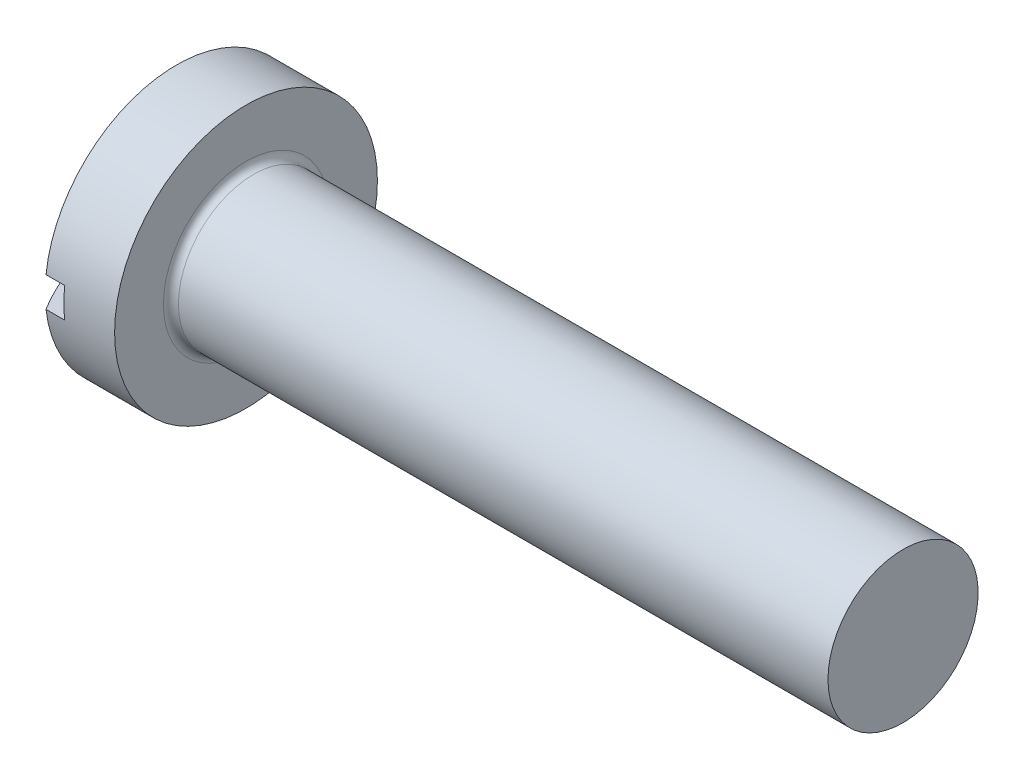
ISO-10303-21;
HEADER;
FILE_DESCRIPTION(('STEP AP214'),'2;1');
FILE_NAME('part.step','',(''),(''),'','','');
FILE_SCHEMA(('AUTOMOTIVE_DESIGN { 1 0 10303 214 1 1 1 1 }'));
ENDSEC;
DATA;
#1=APPLICATION_CONTEXT('core data for automotive mechanical design processes');
#2=APPLICATION_PROTOCOL_DEFINITION('international standard','automotive_design',2000,#1);
#3=PRODUCT_CONTEXT('',#1,'mechanical');
#4=PRODUCT('Part','Part','',(#3));
#5=PRODUCT_RELATED_PRODUCT_CATEGORY('part','',(#4));
#6=PRODUCT_DEFINITION_FORMATION('','',#4);
#7=PRODUCT_DEFINITION_CONTEXT('part definition',#1,'design');
#8=PRODUCT_DEFINITION('design','',#6,#7);
#9=PRODUCT_DEFINITION_SHAPE('','',#8);
#10=(LENGTH_UNIT() NAMED_UNIT(*) SI_UNIT(.MILLI.,.METRE.));
#11=(NAMED_UNIT(*) PLANE_ANGLE_UNIT() SI_UNIT($,.RADIAN.));
#12=(NAMED_UNIT(*) SI_UNIT($,.STERADIAN.) SOLID_ANGLE_UNIT());
#13=UNCERTAINTY_MEASURE_WITH_UNIT(LENGTH_MEASURE(1.E-05),#10,'distance_accuracy_value','');
#14=(GEOMETRIC_REPRESENTATION_CONTEXT(3) GLOBAL_UNCERTAINTY_ASSIGNED_CONTEXT((#13)) GLOBAL_UNIT_ASSIGNED_CONTEXT((#10,
#11,#12)) REPRESENTATION_CONTEXT('',''));
#15=CARTESIAN_POINT('',(0.,0.,0.));
#16=DIRECTION('',(0.,0.,1.));
#17=DIRECTION('',(1.,0.,0.));
#18=AXIS2_PLACEMENT_3D('',#15,#16,#17);
#19=CARTESIAN_POINT('',(13.25,0.,0.));
#20=DIRECTION('',(-1.,0.,0.));
#21=DIRECTION('',(0.,1.,0.));
#22=AXIS2_PLACEMENT_3D('',#19,#20,#21);
#23=SPHERICAL_SURFACE('',#22,13.25);
#24=CARTESIAN_POINT('',(2.,0.,0.));
#25=DIRECTION('',(-1.,0.,0.));
#26=DIRECTION('',(0.,0.,1.));
#27=AXIS2_PLACEMENT_3D('',#24,#25,#26);
#28=CIRCLE('',#27,7.);
#29=CARTESIAN_POINT('',(2.,-0.8,-6.95413546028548));
#30=VERTEX_POINT('',#29);
#31=CARTESIAN_POINT('',(2.,-0.8,6.95413546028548));
#32=VERTEX_POINT('',#31);
#33=EDGE_CURVE('E91',#30,#32,#28,.T.);
#34=ORIENTED_EDGE('',*,*,#33,.T.);
#35=CARTESIAN_POINT('',(13.25,-0.8,0.));
#36=DIRECTION('',(0.,1.,0.));
#37=DIRECTION('',(0.,0.,1.));
#38=AXIS2_PLACEMENT_3D('',#35,#36,#37);
#39=CIRCLE('',#38,13.2258270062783);
#40=EDGE_CURVE('E99',#32,#30,#39,.F.);
#41=ORIENTED_EDGE('',*,*,#40,.T.);
#42=EDGE_LOOP('',(#34,#41));
#43=FACE_BOUND('',#42,.T.);
#44=ADVANCED_FACE('F37',(#43),#23,.T.);
#45=CARTESIAN_POINT('',(2.,0.799999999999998,6.95413546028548));
#46=VERTEX_POINT('',#45);
#47=CARTESIAN_POINT('',(2.,0.8,-6.95413546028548));
#48=VERTEX_POINT('',#47);
#49=EDGE_CURVE('E93',#46,#48,#28,.T.);
#50=ORIENTED_EDGE('',*,*,#49,.T.);
#51=CARTESIAN_POINT('',(13.25,0.799999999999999,0.));
#52=DIRECTION('',(0.,-1.,0.));
#53=DIRECTION('',(0.,0.,-1.));
#54=AXIS2_PLACEMENT_3D('',#51,#52,#53);
#55=CIRCLE('',#54,13.2258270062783);
#56=EDGE_CURVE('E117',#48,#46,#55,.F.);
#57=ORIENTED_EDGE('',*,*,#56,.T.);
#58=EDGE_LOOP('',(#50,#57));
#59=FACE_BOUND('',#58,.T.);
#60=ADVANCED_FACE('F120',(#59),#23,.T.);
#61=CARTESIAN_POINT('',(-25.4,0.,0.));
#62=DIRECTION('',(-1.,0.,0.));
#63=DIRECTION('',(0.,0.,1.));
#64=AXIS2_PLACEMENT_3D('',#61,#62,#63);
#65=CYLINDRICAL_SURFACE('',#64,7.);
#66=CARTESIAN_POINT('',(5.7,0.,0.));
#67=DIRECTION('',(-1.,0.,0.));
#68=DIRECTION('',(0.,0.,1.));
#69=AXIS2_PLACEMENT_3D('',#66,#67,#68);
#70=CIRCLE('',#69,7.);
#71=CARTESIAN_POINT('',(5.7,0.,7.));
#72=VERTEX_POINT('',#71);
#73=EDGE_CURVE('E94',#72,#72,#70,.T.);
#74=ORIENTED_EDGE('',*,*,#73,.T.);
#75=EDGE_LOOP('',(#74));
#76=FACE_BOUND('',#75,.T.);
#77=DIRECTION('',(-1.,0.,0.));
#78=VECTOR('',#77,1.);
#79=CARTESIAN_POINT('',(-25.4,-0.8,-6.95413546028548));
#80=LINE('',#79,#78);
#81=CARTESIAN_POINT('',(3.,-0.8,-6.95413546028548));
#82=VERTEX_POINT('',#81);
#83=EDGE_CURVE('E11',#82,#30,#80,.T.);
#84=ORIENTED_EDGE('',*,*,#83,.F.);
#85=CARTESIAN_POINT('',(3.,0.,0.));
#86=DIRECTION('',(-1.,0.,0.));
#87=DIRECTION('',(0.,0.,1.));
#88=AXIS2_PLACEMENT_3D('',#85,#86,#87);
#89=CIRCLE('',#88,7.);
#90=CARTESIAN_POINT('',(3.,0.8,-6.95413546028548));
#91=VERTEX_POINT('',#90);
#92=EDGE_CURVE('E74',#91,#82,#89,.T.);
#93=ORIENTED_EDGE('',*,*,#92,.F.);
#94=DIRECTION('',(-1.,0.,0.));
#95=VECTOR('',#94,1.);
#96=CARTESIAN_POINT('',(-25.4,0.8,-6.95413546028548));
#97=LINE('',#96,#95);
#98=EDGE_CURVE('E45',#48,#91,#97,.F.);
#99=ORIENTED_EDGE('',*,*,#98,.F.);
#100=ORIENTED_EDGE('',*,*,#49,.F.);
#101=DIRECTION('',(-1.,0.,0.));
#102=VECTOR('',#101,1.);
#103=CARTESIAN_POINT('',(-25.4,0.799999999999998,6.95413546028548));
#104=LINE('',#103,#102);
#105=CARTESIAN_POINT('',(3.,0.799999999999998,6.95413546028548));
#106=VERTEX_POINT('',#105);
#107=EDGE_CURVE('E111',#106,#46,#104,.T.);
#108=ORIENTED_EDGE('',*,*,#107,.F.);
#109=CARTESIAN_POINT('',(3.,-0.8,6.95413546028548));
#110=VERTEX_POINT('',#109);
#111=EDGE_CURVE('E83',#110,#106,#89,.T.);
#112=ORIENTED_EDGE('',*,*,#111,.F.);
#113=DIRECTION('',(-1.,0.,0.));
#114=VECTOR('',#113,1.);
#115=CARTESIAN_POINT('',(-25.4,-0.8,6.95413546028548));
#116=LINE('',#115,#114);
#117=EDGE_CURVE('E81',#32,#110,#116,.F.);
#118=ORIENTED_EDGE('',*,*,#117,.F.);
#119=ORIENTED_EDGE('',*,*,#33,.F.);
#120=EDGE_LOOP('',(#84,#93,#99,#100,#108,#112,#118,#119));
#121=FACE_BOUND('',#120,.T.);
#122=ADVANCED_FACE('F89',(#76,#121),#65,.T.);
#123=CARTESIAN_POINT('',(-25.4,0.,0.));
#124=DIRECTION('',(-1.,0.,0.));
#125=DIRECTION('',(0.,0.,1.));
#126=AXIS2_PLACEMENT_3D('',#123,#124,#125);
#127=CYLINDRICAL_SURFACE('',#126,4.);
#128=CARTESIAN_POINT('',(6.1,0.,0.));
#129=DIRECTION('',(-1.,0.,0.));
#130=DIRECTION('',(0.,0.,1.));
#131=AXIS2_PLACEMENT_3D('',#128,#129,#130);
#132=CIRCLE('',#131,4.);
#133=CARTESIAN_POINT('',(6.1,0.,4.));
#134=VERTEX_POINT('',#133);
#135=EDGE_CURVE('E108',#134,#134,#132,.F.);
#136=ORIENTED_EDGE('',*,*,#135,.T.);
#137=EDGE_LOOP('',(#136));
#138=FACE_BOUND('',#137,.T.);
#139=CARTESIAN_POINT('',(40.7,0.,0.));
#140=DIRECTION('',(-1.,0.,0.));
#141=DIRECTION('',(0.,0.,1.));
#142=AXIS2_PLACEMENT_3D('',#139,#140,#141);
#143=CIRCLE('',#142,4.);
#144=CARTESIAN_POINT('',(40.7,0.,4.));
#145=VERTEX_POINT('',#144);
#146=EDGE_CURVE('E97',#145,#145,#143,.T.);
#147=ORIENTED_EDGE('',*,*,#146,.T.);
#148=EDGE_LOOP('',(#147));
#149=FACE_BOUND('',#148,.T.);
#150=ADVANCED_FACE('F134',(#138,#149),#127,.T.);
#151=CARTESIAN_POINT('',(40.7,4.,0.));
#152=DIRECTION('',(1.,0.,0.));
#153=DIRECTION('',(0.,0.,-1.));
#154=AXIS2_PLACEMENT_3D('',#151,#152,#153);
#155=PLANE('',#154);
#156=ORIENTED_EDGE('',*,*,#146,.F.);
#157=EDGE_LOOP('',(#156));
#158=FACE_BOUND('',#157,.T.);
#159=ADVANCED_FACE('F131',(#158),#155,.T.);
#160=CARTESIAN_POINT('',(5.7,4.,0.));
#161=DIRECTION('',(-1.,0.,0.));
#162=DIRECTION('',(0.,0.,1.));
#163=AXIS2_PLACEMENT_3D('',#160,#161,#162);
#164=PLANE('',#163);
#165=CARTESIAN_POINT('',(5.7,0.,0.));
#166=DIRECTION('',(-1.,0.,0.));
#167=DIRECTION('',(0.,0.,1.));
#168=AXIS2_PLACEMENT_3D('',#165,#166,#167);
#169=CIRCLE('',#168,4.4);
#170=CARTESIAN_POINT('',(5.7,0.,4.4));
#171=VERTEX_POINT('',#170);
#172=EDGE_CURVE('E105',#171,#171,#169,.T.);
#173=ORIENTED_EDGE('',*,*,#172,.T.);
#174=EDGE_LOOP('',(#173));
#175=FACE_BOUND('',#174,.T.);
#176=ORIENTED_EDGE('',*,*,#73,.F.);
#177=EDGE_LOOP('',(#176));
#178=FACE_BOUND('',#177,.T.);
#179=ADVANCED_FACE('F133',(#175,#178),#164,.F.);
#180=CARTESIAN_POINT('',(6.1,0.,0.));
#181=DIRECTION('',(-1.,0.,0.));
#182=DIRECTION('',(0.,0.,1.));
#183=AXIS2_PLACEMENT_3D('',#180,#181,#182);
#184=TOROIDAL_SURFACE('',#183,4.4,0.4);
#185=ORIENTED_EDGE('',*,*,#135,.F.);
#186=EDGE_LOOP('',(#185));
#187=FACE_BOUND('',#186,.T.);
#188=ORIENTED_EDGE('',*,*,#172,.F.);
#189=EDGE_LOOP('',(#188));
#190=FACE_BOUND('',#189,.T.);
#191=ADVANCED_FACE('F39',(#187,#190),#184,.F.);
#192=CARTESIAN_POINT('',(3.,-0.8,7.));
#193=DIRECTION('',(0.,1.,0.));
#194=DIRECTION('',(0.,0.,1.));
#195=AXIS2_PLACEMENT_3D('',#192,#193,#194);
#196=PLANE('',#195);
#197=ORIENTED_EDGE('',*,*,#83,.T.);
#198=ORIENTED_EDGE('',*,*,#40,.F.);
#199=ORIENTED_EDGE('',*,*,#117,.T.);
#200=DIRECTION('',(0.,0.,-1.));
#201=VECTOR('',#200,1.);
#202=CARTESIAN_POINT('',(3.,-0.8,7.));
#203=LINE('',#202,#201);
#204=EDGE_CURVE('E52',#110,#82,#203,.T.);
#205=ORIENTED_EDGE('',*,*,#204,.T.);
#206=EDGE_LOOP('',(#197,#198,#199,#205));
#207=FACE_BOUND('',#206,.T.);
#208=ADVANCED_FACE('F84',(#207),#196,.T.);
#209=CARTESIAN_POINT('',(3.,0.8,-7.));
#210=DIRECTION('',(0.,-1.,0.));
#211=DIRECTION('',(0.,0.,-1.));
#212=AXIS2_PLACEMENT_3D('',#209,#210,#211);
#213=PLANE('',#212);
#214=ORIENTED_EDGE('',*,*,#107,.T.);
#215=ORIENTED_EDGE('',*,*,#56,.F.);
#216=ORIENTED_EDGE('',*,*,#98,.T.);
#217=DIRECTION('',(0.,0.,1.));
#218=VECTOR('',#217,1.);
#219=CARTESIAN_POINT('',(3.,0.8,-7.));
#220=LINE('',#219,#218);
#221=EDGE_CURVE('E77',#91,#106,#220,.T.);
#222=ORIENTED_EDGE('',*,*,#221,.T.);
#223=EDGE_LOOP('',(#214,#215,#216,#222));
#224=FACE_BOUND('',#223,.T.);
#225=ADVANCED_FACE('F114',(#224),#213,.T.);
#226=CARTESIAN_POINT('',(3.,-0.8,7.));
#227=DIRECTION('',(-1.,0.,0.));
#228=DIRECTION('',(0.,0.,1.));
#229=AXIS2_PLACEMENT_3D('',#226,#227,#228);
#230=PLANE('',#229);
#231=ORIENTED_EDGE('',*,*,#221,.F.);
#232=ORIENTED_EDGE('',*,*,#92,.T.);
#233=ORIENTED_EDGE('',*,*,#204,.F.);
#234=ORIENTED_EDGE('',*,*,#111,.T.);
#235=EDGE_LOOP('',(#231,#232,#233,#234));
#236=FACE_BOUND('',#235,.T.);
#237=ADVANCED_FACE('F75',(#236),#230,.T.);
#238=CLOSED_SHELL('',(#44,#60,#122,#150,#159,#179,#191,#208,#225,#237));
#239=MANIFOLD_SOLID_BREP('B2',#238);
#240=ADVANCED_BREP_SHAPE_REPRESENTATION('',(#18,#239),#14);
#241=SHAPE_DEFINITION_REPRESENTATION(#9,#240);
ENDSEC;
END-ISO-10303-21;
